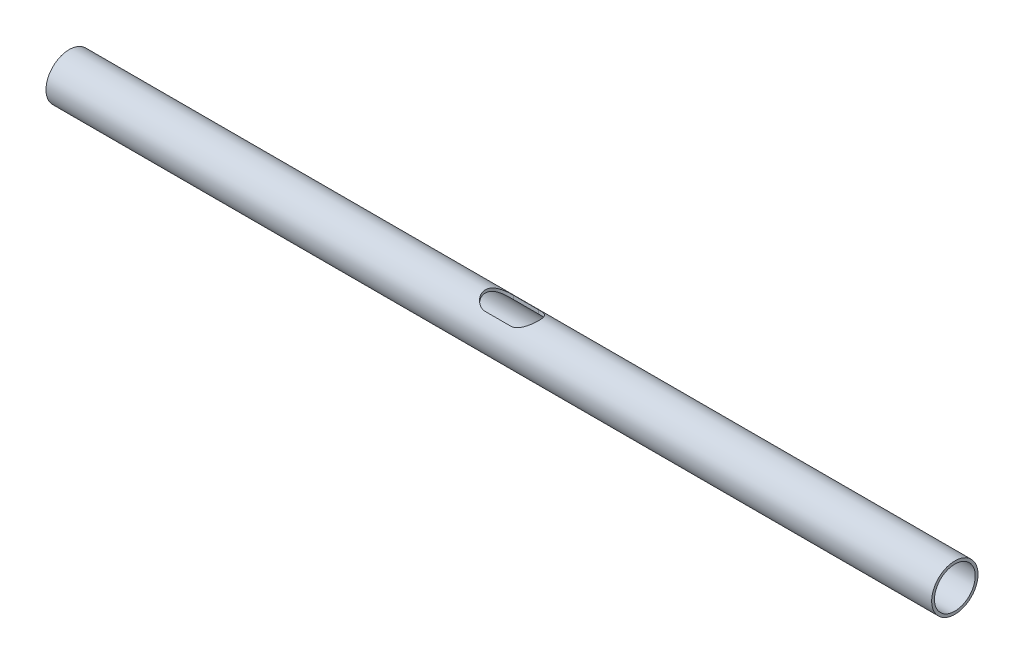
from build123d import *

# Parameters (mm, degrees)
ESQUISSE1_W             = 630
ESQUISSE1_H             = 2
ENL_V_MAT_EXTRU_1_DEPTH = 36


with BuildPart() as part:
    # Esquisse1 → R_volution1 (revolve)
    with BuildSketch(Plane.XY, mode=Mode.PRIVATE) as r_volution1_sk:
        with Locations((0, 15.5)):
            Rectangle(ESQUISSE1_W, ESQUISSE1_H)
    revolve(r_volution1_sk.sketch.rotate(Axis((-68.817663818, 0, 0), (1, 0, 0)), 90), axis=Axis((-68.817663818, 0, 0), (1, 0, 0)))

    # Esquisse2 → Enl_v. mat.-Extru.1 (cut)
    with BuildSketch(Plane(origin=(0, 0, 0), x_dir=(1, 0, 0), z_dir=(0, 1, 0))):
        with BuildLine():
            Line((9, -10), (-9, -10))
            ThreePointArc((-9, -10), (-19, 0), (-9, 10))
            Line((-9, 10), (9, 10))
            ThreePointArc((9, 10), (19, 0), (9, -10))
        make_face()
    extrude(amount=ENL_V_MAT_EXTRU_1_DEPTH, mode=Mode.SUBTRACT)


solid = part.part
